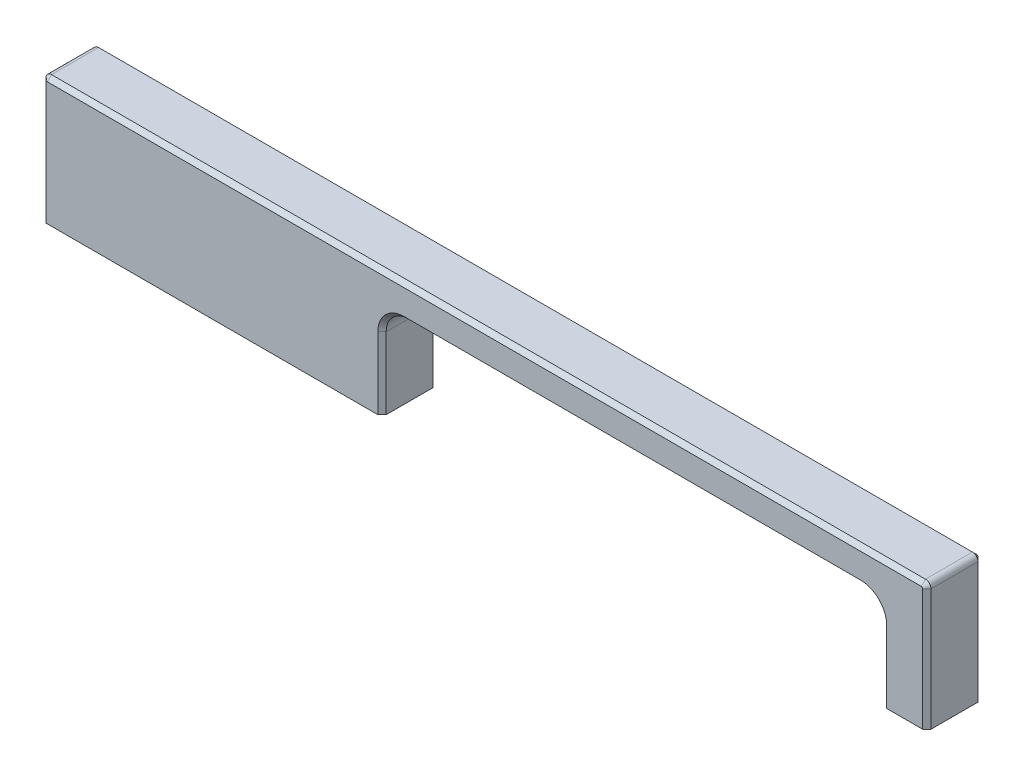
from build123d import *

# Parameters (mm, degrees)
EXTRUDE_1_DEPTH = 5
M4X0_7_1_D      = 3.3
M4X0_7_1_DEPTH  = 11.5
M4X0_7_1_TIP    = 0.991420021
FILLET_1_R      = 4
FILLET_2_R      = 1
CHAMFER_1_SIZE  = 0.75


with BuildPart() as part:
    # Sketch 1 → Extrude 1 (new, symmetric)
    with BuildSketch(Plane.XY):
        Polygon((80, 0), (72, 0), (72, 17), (-18.5, 17), (-18.5, 0), (-80, 0), (-80, 23), (80, 23), align=None)
    extrude(amount=EXTRUDE_1_DEPTH, both=True)

    # M4x0.7 _1
    with Locations(Plane(origin=(0, 0, 0), x_dir=(-1, 0, 0), z_dir=(0, -1, 0))):
        with Locations((-76, 0), (54, 0)):
            Hole(M4X0_7_1_D / 2, depth=M4X0_7_1_DEPTH)
            with Locations((0, 0, -(M4X0_7_1_DEPTH + M4X0_7_1_TIP / 2))):  # 118° drill point
                Cone(0, M4X0_7_1_D / 2, M4X0_7_1_TIP, mode=Mode.SUBTRACT)

    # Fillet 1
    fillet_1_edges = [part.edges().sort_by_distance(p)[0] for p in [
        (72, 17, 0),
        (-18.5, 17, 0),
    ]]
    fillet(fillet_1_edges, radius=FILLET_1_R)

    # Fillet 2
    fillet_2_edges = [part.edges().sort_by_distance(p)[0] for p in [
        (-80, 23, 0),
        (80, 23, 0),
    ]]
    fillet(fillet_2_edges, radius=FILLET_2_R)

    # Chamfer 1
    chamfer_1_edges = [part.edges().sort_by_distance(p)[0] for p in [
        (80, 11, -5),
        (-18.5, 6.5, 5),
        (72, 6.5, -5),
        (72, 6.5, 5),
        (26.75, 17, -5),
        (26.75, 17, 5),
        (70.828427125, 15.828427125, -5),
        (70.828427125, 15.828427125, 5),
        (-17.328427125, 15.828427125, -5),
        (-17.328427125, 15.828427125, 5),
        (0, 23, -5),
        (0, 23, 5),
        (-80, 11, -5),
        (-79.707106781, 22.707106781, -5),
        (79.707106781, 22.707106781, -5),
        (80, 11, 5),
        (-80, 11, 5),
        (-79.707106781, 22.707106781, 5),
        (79.707106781, 22.707106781, 5),
        (-18.5, 6.5, -5),
    ]]
    chamfer(chamfer_1_edges, length=CHAMFER_1_SIZE)


solid = part.part
